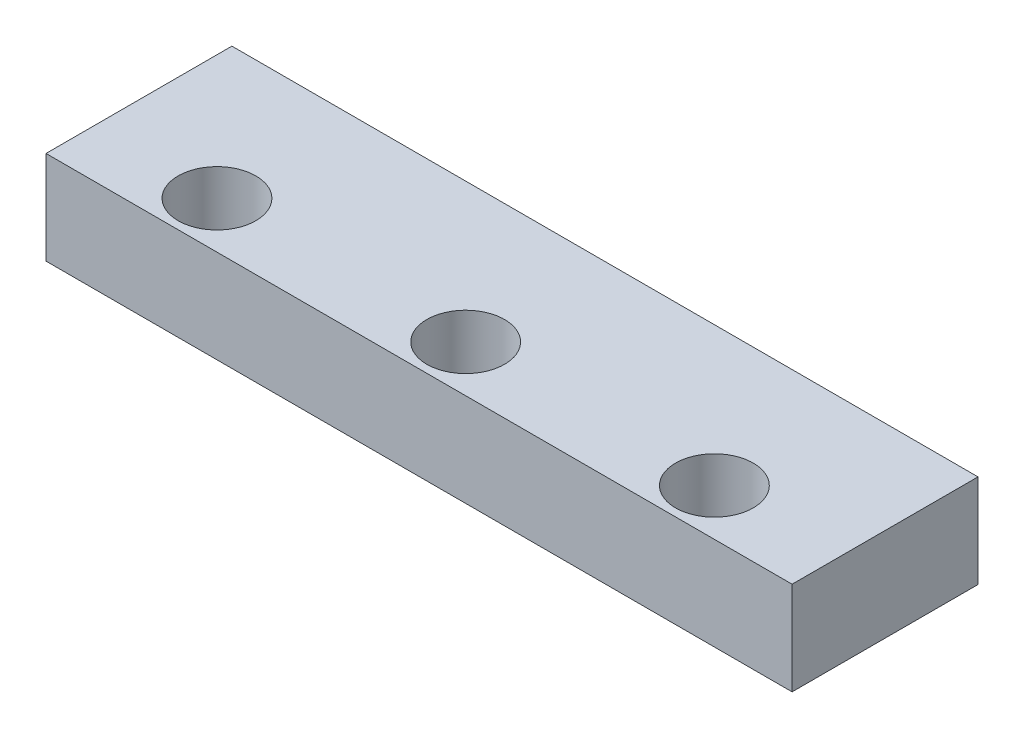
from build123d import *

# Parameters (mm, degrees)
SKETCH1_W           = 120
SKETCH1_H           = 15
BOSS_EXTRUDE1_DEPTH = 30
SKETCH3_R           = 6.25
CUT_EXTRUDE1_DEPTH  = 10
SKETCH4_R           = 4
CUT_EXTRUDE2_DEPTH  = 10
SKETCH5_W           = 0.1
SKETCH5_H           = 17.389780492
CUT_EXTRUDE3_DEPTH  = 133


with BuildPart() as part:
    # Sketch1 → Boss-Extrude1 (new body)
    with BuildSketch(Plane.XY):
        with Locations((60, -7.5)):
            Rectangle(SKETCH1_W, SKETCH1_H)
    extrude(amount=BOSS_EXTRUDE1_DEPTH)

    # Sketch3 → Cut-Extrude1 (cut)
    with BuildSketch(Plane(origin=(0, 0, 0), x_dir=(1, 0, 0), z_dir=(0, 1, 0))):
        with Locations(Location((20, -22.5, 0), (0, 0, 270))):
            Circle(SKETCH3_R)
        with Locations(Location((60, -22.5, 0), (0, 0, 270))):
            Circle(SKETCH3_R)
        with Locations(Location((100, -22.5, 0), (0, 0, 270))):
            Circle(SKETCH3_R)
    extrude(amount=-CUT_EXTRUDE1_DEPTH, mode=Mode.SUBTRACT)

    # Sketch4 → Cut-Extrude2 (cut)
    with BuildSketch(Plane(origin=(0, -10, 0), x_dir=(1, 0, 0), z_dir=(0, 1, 0))):
        with Locations(Location((20, -22.5, 0), (0, 0, 270))):
            Circle(SKETCH4_R)
        with Locations(Location((60, -22.5, 0), (0, 0, 270))):
            Circle(SKETCH4_R)
        with Locations(Location((100, -22.5, 0), (0, 0, 270))):
            Circle(SKETCH4_R)
    extrude(amount=-CUT_EXTRUDE2_DEPTH, mode=Mode.SUBTRACT)

    # Sketch5 → Cut-Extrude3 (cut)
    with BuildSketch(Plane.ZY):
        with Locations((0.05, -8.694890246)):
            Rectangle(SKETCH5_W, SKETCH5_H)
    extrude(amount=-CUT_EXTRUDE3_DEPTH, mode=Mode.SUBTRACT)


solid = part.part
